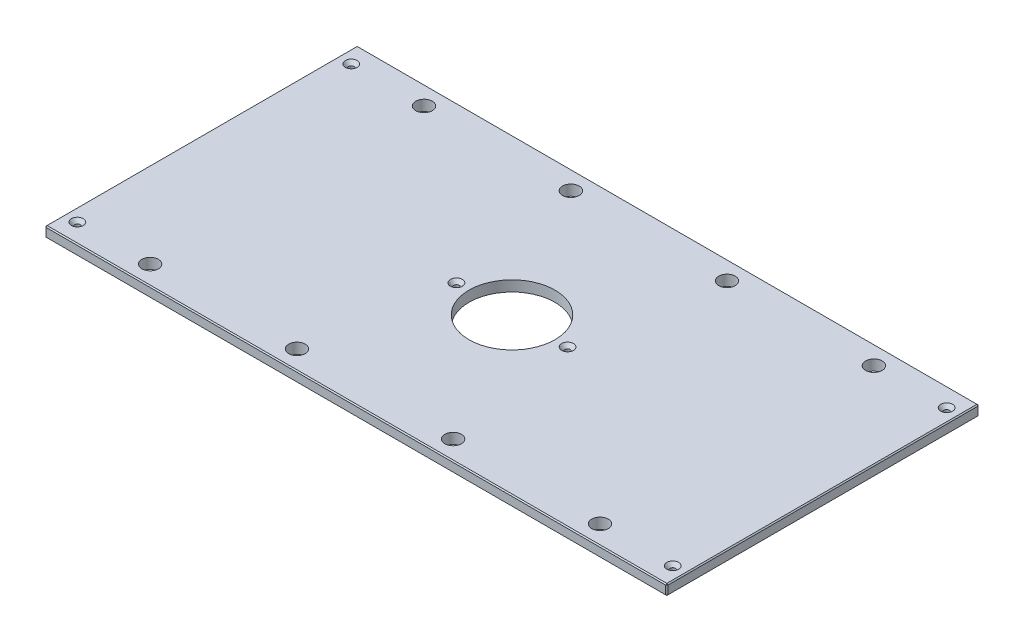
ISO-10303-21;
HEADER;
FILE_DESCRIPTION(('STEP AP214'),'2;1');
FILE_NAME('part.step','',(''),(''),'','','');
FILE_SCHEMA(('AUTOMOTIVE_DESIGN { 1 0 10303 214 1 1 1 1 }'));
ENDSEC;
DATA;
#1=APPLICATION_CONTEXT('core data for automotive mechanical design processes');
#2=APPLICATION_PROTOCOL_DEFINITION('international standard','automotive_design',2000,#1);
#3=PRODUCT_CONTEXT('',#1,'mechanical');
#4=PRODUCT('Part','Part','',(#3));
#5=PRODUCT_RELATED_PRODUCT_CATEGORY('part','',(#4));
#6=PRODUCT_DEFINITION_FORMATION('','',#4);
#7=PRODUCT_DEFINITION_CONTEXT('part definition',#1,'design');
#8=PRODUCT_DEFINITION('design','',#6,#7);
#9=PRODUCT_DEFINITION_SHAPE('','',#8);
#10=(LENGTH_UNIT() NAMED_UNIT(*) SI_UNIT(.MILLI.,.METRE.));
#11=(NAMED_UNIT(*) PLANE_ANGLE_UNIT() SI_UNIT($,.RADIAN.));
#12=(NAMED_UNIT(*) SI_UNIT($,.STERADIAN.) SOLID_ANGLE_UNIT());
#13=UNCERTAINTY_MEASURE_WITH_UNIT(LENGTH_MEASURE(1.E-05),#10,'distance_accuracy_value','');
#14=(GEOMETRIC_REPRESENTATION_CONTEXT(3) GLOBAL_UNCERTAINTY_ASSIGNED_CONTEXT((#13)) GLOBAL_UNIT_ASSIGNED_CONTEXT((#10,
#11,#12)) REPRESENTATION_CONTEXT('',''));
#15=CARTESIAN_POINT('',(0.,0.,0.));
#16=DIRECTION('',(0.,0.,1.));
#17=DIRECTION('',(1.,0.,0.));
#18=AXIS2_PLACEMENT_3D('',#15,#16,#17);
#19=CARTESIAN_POINT('',(-373.0625,12.7,-187.325));
#20=DIRECTION('',(1.,0.,0.));
#21=DIRECTION('',(0.,0.,-1.));
#22=AXIS2_PLACEMENT_3D('',#19,#20,#21);
#23=PLANE('',#22);
#24=DIRECTION('',(0.,0.,-1.));
#25=VECTOR('',#24,1.);
#26=CARTESIAN_POINT('',(-373.0625,11.4299999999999,-187.325));
#27=LINE('',#26,#25);
#28=CARTESIAN_POINT('',(-373.0625,11.4299999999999,186.055));
#29=VERTEX_POINT('',#28);
#30=CARTESIAN_POINT('',(-373.0625,11.4299999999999,-186.055));
#31=VERTEX_POINT('',#30);
#32=EDGE_CURVE('E135',#29,#31,#27,.T.);
#33=ORIENTED_EDGE('',*,*,#32,.T.);
#34=DIRECTION('',(0.,-1.,0.));
#35=VECTOR('',#34,1.);
#36=CARTESIAN_POINT('',(-373.0625,12.7,-186.055));
#37=LINE('',#36,#35);
#38=CARTESIAN_POINT('',(-373.0625,1.2700000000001,-186.055));
#39=VERTEX_POINT('',#38);
#40=EDGE_CURVE('E131',#31,#39,#37,.T.);
#41=ORIENTED_EDGE('',*,*,#40,.T.);
#42=DIRECTION('',(0.,0.,1.));
#43=VECTOR('',#42,1.);
#44=CARTESIAN_POINT('',(-373.0625,1.2700000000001,-187.325));
#45=LINE('',#44,#43);
#46=CARTESIAN_POINT('',(-373.0625,1.2700000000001,186.055));
#47=VERTEX_POINT('',#46);
#48=EDGE_CURVE('E126',#39,#47,#45,.T.);
#49=ORIENTED_EDGE('',*,*,#48,.T.);
#50=DIRECTION('',(0.,1.,0.));
#51=VECTOR('',#50,1.);
#52=CARTESIAN_POINT('',(-373.0625,12.7,186.055));
#53=LINE('',#52,#51);
#54=EDGE_CURVE('E128',#47,#29,#53,.T.);
#55=ORIENTED_EDGE('',*,*,#54,.T.);
#56=EDGE_LOOP('',(#33,#41,#49,#55));
#57=FACE_BOUND('',#56,.T.);
#58=ADVANCED_FACE('F35',(#57),#23,.F.);
#59=CARTESIAN_POINT('',(-373.0625,12.7,187.325));
#60=DIRECTION('',(0.,0.,-1.));
#61=DIRECTION('',(-1.,0.,0.));
#62=AXIS2_PLACEMENT_3D('',#59,#60,#61);
#63=PLANE('',#62);
#64=DIRECTION('',(1.,0.,0.));
#65=VECTOR('',#64,1.);
#66=CARTESIAN_POINT('',(-373.0625,1.26999999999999,187.325));
#67=LINE('',#66,#65);
#68=CARTESIAN_POINT('',(-371.7925,1.26999999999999,187.325));
#69=VERTEX_POINT('',#68);
#70=CARTESIAN_POINT('',(371.7925,1.26999999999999,187.325));
#71=VERTEX_POINT('',#70);
#72=EDGE_CURVE('E58',#69,#71,#67,.T.);
#73=ORIENTED_EDGE('',*,*,#72,.T.);
#74=DIRECTION('',(0.,1.,0.));
#75=VECTOR('',#74,1.);
#76=CARTESIAN_POINT('',(371.7925,12.7,187.325));
#77=LINE('',#76,#75);
#78=CARTESIAN_POINT('',(371.7925,11.43,187.325));
#79=VERTEX_POINT('',#78);
#80=EDGE_CURVE('E11',#71,#79,#77,.T.);
#81=ORIENTED_EDGE('',*,*,#80,.T.);
#82=DIRECTION('',(-1.,0.,0.));
#83=VECTOR('',#82,1.);
#84=CARTESIAN_POINT('',(-373.0625,11.43,187.325));
#85=LINE('',#84,#83);
#86=CARTESIAN_POINT('',(-371.7925,11.43,187.325));
#87=VERTEX_POINT('',#86);
#88=EDGE_CURVE('E44',#79,#87,#85,.T.);
#89=ORIENTED_EDGE('',*,*,#88,.T.);
#90=DIRECTION('',(0.,-1.,0.));
#91=VECTOR('',#90,1.);
#92=CARTESIAN_POINT('',(-371.7925,12.7,187.325));
#93=LINE('',#92,#91);
#94=EDGE_CURVE('E303',#87,#69,#93,.T.);
#95=ORIENTED_EDGE('',*,*,#94,.T.);
#96=EDGE_LOOP('',(#73,#81,#89,#95));
#97=FACE_BOUND('',#96,.T.);
#98=ADVANCED_FACE('F372',(#97),#63,.F.);
#99=CARTESIAN_POINT('',(373.0625,12.7,-187.325));
#100=DIRECTION('',(-1.,0.,0.));
#101=DIRECTION('',(0.,0.,1.));
#102=AXIS2_PLACEMENT_3D('',#99,#100,#101);
#103=PLANE('',#102);
#104=DIRECTION('',(0.,0.,-1.));
#105=VECTOR('',#104,1.);
#106=CARTESIAN_POINT('',(373.0625,1.26999999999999,-187.325));
#107=LINE('',#106,#105);
#108=CARTESIAN_POINT('',(373.0625,1.26999999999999,186.055));
#109=VERTEX_POINT('',#108);
#110=CARTESIAN_POINT('',(373.0625,1.26999999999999,-186.055));
#111=VERTEX_POINT('',#110);
#112=EDGE_CURVE('E298',#109,#111,#107,.T.);
#113=ORIENTED_EDGE('',*,*,#112,.T.);
#114=DIRECTION('',(0.,1.,0.));
#115=VECTOR('',#114,1.);
#116=CARTESIAN_POINT('',(373.0625,12.7,-186.055));
#117=LINE('',#116,#115);
#118=CARTESIAN_POINT('',(373.0625,11.4299999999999,-186.055));
#119=VERTEX_POINT('',#118);
#120=EDGE_CURVE('E300',#111,#119,#117,.T.);
#121=ORIENTED_EDGE('',*,*,#120,.T.);
#122=DIRECTION('',(0.,0.,1.));
#123=VECTOR('',#122,1.);
#124=CARTESIAN_POINT('',(373.0625,11.4299999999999,187.325));
#125=LINE('',#124,#123);
#126=CARTESIAN_POINT('',(373.0625,11.4299999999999,186.055));
#127=VERTEX_POINT('',#126);
#128=EDGE_CURVE('E296',#119,#127,#125,.T.);
#129=ORIENTED_EDGE('',*,*,#128,.T.);
#130=DIRECTION('',(0.,-1.,0.));
#131=VECTOR('',#130,1.);
#132=CARTESIAN_POINT('',(373.0625,12.7,186.055));
#133=LINE('',#132,#131);
#134=EDGE_CURVE('E294',#127,#109,#133,.T.);
#135=ORIENTED_EDGE('',*,*,#134,.T.);
#136=EDGE_LOOP('',(#113,#121,#129,#135));
#137=FACE_BOUND('',#136,.T.);
#138=ADVANCED_FACE('F359',(#137),#103,.F.);
#139=CARTESIAN_POINT('',(-373.0625,12.7,-187.325));
#140=DIRECTION('',(0.,0.,1.));
#141=DIRECTION('',(1.,0.,0.));
#142=AXIS2_PLACEMENT_3D('',#139,#140,#141);
#143=PLANE('',#142);
#144=DIRECTION('',(-1.,0.,0.));
#145=VECTOR('',#144,1.);
#146=CARTESIAN_POINT('',(-373.0625,1.26999999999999,-187.325));
#147=LINE('',#146,#145);
#148=CARTESIAN_POINT('',(371.7925,1.26999999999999,-187.325));
#149=VERTEX_POINT('',#148);
#150=CARTESIAN_POINT('',(-371.7925,1.26999999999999,-187.325));
#151=VERTEX_POINT('',#150);
#152=EDGE_CURVE('E270',#149,#151,#147,.T.);
#153=ORIENTED_EDGE('',*,*,#152,.T.);
#154=DIRECTION('',(0.,1.,0.));
#155=VECTOR('',#154,1.);
#156=CARTESIAN_POINT('',(-371.7925,12.7,-187.325));
#157=LINE('',#156,#155);
#158=CARTESIAN_POINT('',(-371.7925,11.4299999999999,-187.325));
#159=VERTEX_POINT('',#158);
#160=EDGE_CURVE('E274',#151,#159,#157,.T.);
#161=ORIENTED_EDGE('',*,*,#160,.T.);
#162=DIRECTION('',(1.,0.,0.));
#163=VECTOR('',#162,1.);
#164=CARTESIAN_POINT('',(373.0625,11.4299999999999,-187.325));
#165=LINE('',#164,#163);
#166=CARTESIAN_POINT('',(371.7925,11.4299999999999,-187.325));
#167=VERTEX_POINT('',#166);
#168=EDGE_CURVE('E272',#159,#167,#165,.T.);
#169=ORIENTED_EDGE('',*,*,#168,.T.);
#170=DIRECTION('',(0.,-1.,0.));
#171=VECTOR('',#170,1.);
#172=CARTESIAN_POINT('',(371.7925,12.7,-187.325));
#173=LINE('',#172,#171);
#174=EDGE_CURVE('E268',#167,#149,#173,.T.);
#175=ORIENTED_EDGE('',*,*,#174,.T.);
#176=EDGE_LOOP('',(#153,#161,#169,#175));
#177=FACE_BOUND('',#176,.T.);
#178=ADVANCED_FACE('F333',(#177),#143,.F.);
#179=CARTESIAN_POINT('',(0.,12.7,0.));
#180=DIRECTION('',(0.,1.,0.));
#181=DIRECTION('',(0.,0.,1.));
#182=AXIS2_PLACEMENT_3D('',#179,#180,#181);
#183=PLANE('',#182);
#184=CARTESIAN_POINT('',(357.1875,12.7,-164.30498));
#185=DIRECTION('',(0.,1.,0.));
#186=DIRECTION('',(0.,0.,1.));
#187=AXIS2_PLACEMENT_3D('',#184,#185,#186);
#188=CIRCLE('',#187,7.13740000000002);
#189=CARTESIAN_POINT('',(357.1875,12.7,-157.16758));
#190=VERTEX_POINT('',#189);
#191=EDGE_CURVE('E816',#190,#190,#188,.T.);
#192=ORIENTED_EDGE('',*,*,#191,.F.);
#193=EDGE_LOOP('',(#192));
#194=FACE_BOUND('',#193,.T.);
#195=CARTESIAN_POINT('',(357.1875,12.7,164.30498));
#196=DIRECTION('',(0.,1.,0.));
#197=DIRECTION('',(0.,0.,1.));
#198=AXIS2_PLACEMENT_3D('',#195,#196,#197);
#199=CIRCLE('',#198,7.13740000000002);
#200=CARTESIAN_POINT('',(357.1875,12.7,171.44238));
#201=VERTEX_POINT('',#200);
#202=EDGE_CURVE('E820',#201,#201,#199,.T.);
#203=ORIENTED_EDGE('',*,*,#202,.F.);
#204=EDGE_LOOP('',(#203));
#205=FACE_BOUND('',#204,.T.);
#206=CARTESIAN_POINT('',(-357.1875,12.7,164.30498));
#207=DIRECTION('',(0.,1.,0.));
#208=DIRECTION('',(0.,0.,1.));
#209=AXIS2_PLACEMENT_3D('',#206,#207,#208);
#210=CIRCLE('',#209,7.13740000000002);
#211=CARTESIAN_POINT('',(-357.1875,12.7,171.44238));
#212=VERTEX_POINT('',#211);
#213=EDGE_CURVE('E824',#212,#212,#210,.T.);
#214=ORIENTED_EDGE('',*,*,#213,.F.);
#215=EDGE_LOOP('',(#214));
#216=FACE_BOUND('',#215,.T.);
#217=CARTESIAN_POINT('',(-66.675,12.7,0.));
#218=DIRECTION('',(0.,1.,0.));
#219=DIRECTION('',(0.,0.,1.));
#220=AXIS2_PLACEMENT_3D('',#217,#218,#219);
#221=CIRCLE('',#220,7.1374);
#222=CARTESIAN_POINT('',(-66.675,12.7,7.1374));
#223=VERTEX_POINT('',#222);
#224=EDGE_CURVE('E828',#223,#223,#221,.T.);
#225=ORIENTED_EDGE('',*,*,#224,.F.);
#226=EDGE_LOOP('',(#225));
#227=FACE_BOUND('',#226,.T.);
#228=CARTESIAN_POINT('',(66.675,12.7,0.));
#229=DIRECTION('',(0.,1.,0.));
#230=DIRECTION('',(0.,0.,1.));
#231=AXIS2_PLACEMENT_3D('',#228,#229,#230);
#232=CIRCLE('',#231,7.1374);
#233=CARTESIAN_POINT('',(66.675,12.7,7.1374));
#234=VERTEX_POINT('',#233);
#235=EDGE_CURVE('E832',#234,#234,#232,.T.);
#236=ORIENTED_EDGE('',*,*,#235,.F.);
#237=EDGE_LOOP('',(#236));
#238=FACE_BOUND('',#237,.T.);
#239=CARTESIAN_POINT('',(-357.1875,12.7,-164.30498));
#240=DIRECTION('',(0.,1.,0.));
#241=DIRECTION('',(0.,0.,1.));
#242=AXIS2_PLACEMENT_3D('',#239,#240,#241);
#243=CIRCLE('',#242,7.13740000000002);
#244=CARTESIAN_POINT('',(-357.1875,12.7,-157.16758));
#245=VERTEX_POINT('',#244);
#246=EDGE_CURVE('E835',#245,#245,#243,.T.);
#247=ORIENTED_EDGE('',*,*,#246,.F.);
#248=EDGE_LOOP('',(#247));
#249=FACE_BOUND('',#248,.T.);
#250=DIRECTION('',(0.,0.,-1.));
#251=VECTOR('',#250,1.);
#252=CARTESIAN_POINT('',(371.7925,12.7,-187.325));
#253=LINE('',#252,#251);
#254=CARTESIAN_POINT('',(371.7925,12.7,186.055));
#255=VERTEX_POINT('',#254);
#256=CARTESIAN_POINT('',(371.7925,12.7,-186.055));
#257=VERTEX_POINT('',#256);
#258=EDGE_CURVE('E281',#255,#257,#253,.T.);
#259=ORIENTED_EDGE('',*,*,#258,.T.);
#260=DIRECTION('',(-1.,0.,0.));
#261=VECTOR('',#260,1.);
#262=CARTESIAN_POINT('',(-373.0625,12.7,-186.055));
#263=LINE('',#262,#261);
#264=CARTESIAN_POINT('',(-371.7925,12.7,-186.055));
#265=VERTEX_POINT('',#264);
#266=EDGE_CURVE('E283',#257,#265,#263,.T.);
#267=ORIENTED_EDGE('',*,*,#266,.T.);
#268=DIRECTION('',(0.,0.,1.));
#269=VECTOR('',#268,1.);
#270=CARTESIAN_POINT('',(-371.7925,12.7,187.325));
#271=LINE('',#270,#269);
#272=CARTESIAN_POINT('',(-371.7925,12.7,186.055));
#273=VERTEX_POINT('',#272);
#274=EDGE_CURVE('E279',#265,#273,#271,.T.);
#275=ORIENTED_EDGE('',*,*,#274,.T.);
#276=DIRECTION('',(1.,0.,0.));
#277=VECTOR('',#276,1.);
#278=CARTESIAN_POINT('',(373.0625,12.7,186.055));
#279=LINE('',#278,#277);
#280=EDGE_CURVE('E277',#273,#255,#279,.T.);
#281=ORIENTED_EDGE('',*,*,#280,.T.);
#282=EDGE_LOOP('',(#259,#267,#275,#281));
#283=FACE_BOUND('',#282,.T.);
#284=CARTESIAN_POINT('',(269.875,12.7,-164.30498));
#285=DIRECTION('',(0.,1.,0.));
#286=DIRECTION('',(0.,0.,1.));
#287=AXIS2_PLACEMENT_3D('',#284,#285,#286);
#288=CIRCLE('',#287,9.92187500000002);
#289=CARTESIAN_POINT('',(269.875,12.7,-154.383105));
#290=VERTEX_POINT('',#289);
#291=EDGE_CURVE('E204',#290,#290,#288,.T.);
#292=ORIENTED_EDGE('',*,*,#291,.F.);
#293=EDGE_LOOP('',(#292));
#294=FACE_BOUND('',#293,.T.);
#295=CARTESIAN_POINT('',(-269.875,12.7,-164.30498));
#296=DIRECTION('',(0.,1.,0.));
#297=DIRECTION('',(0.,0.,1.));
#298=AXIS2_PLACEMENT_3D('',#295,#296,#297);
#299=CIRCLE('',#298,9.92187500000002);
#300=CARTESIAN_POINT('',(-269.875,12.7,-154.383105));
#301=VERTEX_POINT('',#300);
#302=EDGE_CURVE('E214',#301,#301,#299,.T.);
#303=ORIENTED_EDGE('',*,*,#302,.F.);
#304=EDGE_LOOP('',(#303));
#305=FACE_BOUND('',#304,.T.);
#306=CARTESIAN_POINT('',(269.875,12.7,164.30498));
#307=DIRECTION('',(0.,1.,0.));
#308=DIRECTION('',(0.,0.,1.));
#309=AXIS2_PLACEMENT_3D('',#306,#307,#308);
#310=CIRCLE('',#309,9.92187500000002);
#311=CARTESIAN_POINT('',(269.875,12.7,174.226855));
#312=VERTEX_POINT('',#311);
#313=EDGE_CURVE('E225',#312,#312,#310,.T.);
#314=ORIENTED_EDGE('',*,*,#313,.F.);
#315=EDGE_LOOP('',(#314));
#316=FACE_BOUND('',#315,.T.);
#317=CARTESIAN_POINT('',(-269.875,12.7,164.30498));
#318=DIRECTION('',(0.,1.,0.));
#319=DIRECTION('',(0.,0.,1.));
#320=AXIS2_PLACEMENT_3D('',#317,#318,#319);
#321=CIRCLE('',#320,9.92187500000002);
#322=CARTESIAN_POINT('',(-269.875,12.7,174.226855));
#323=VERTEX_POINT('',#322);
#324=EDGE_CURVE('E231',#323,#323,#321,.T.);
#325=ORIENTED_EDGE('',*,*,#324,.F.);
#326=EDGE_LOOP('',(#325));
#327=FACE_BOUND('',#326,.T.);
#328=CARTESIAN_POINT('',(-93.6625,12.7,-164.30498));
#329=DIRECTION('',(0.,1.,0.));
#330=DIRECTION('',(0.,0.,1.));
#331=AXIS2_PLACEMENT_3D('',#328,#329,#330);
#332=CIRCLE('',#331,9.921875);
#333=CARTESIAN_POINT('',(-93.6625,12.7,-154.383105));
#334=VERTEX_POINT('',#333);
#335=EDGE_CURVE('E237',#334,#334,#332,.T.);
#336=ORIENTED_EDGE('',*,*,#335,.F.);
#337=EDGE_LOOP('',(#336));
#338=FACE_BOUND('',#337,.T.);
#339=CARTESIAN_POINT('',(93.6625,12.7,-164.30498));
#340=DIRECTION('',(0.,1.,0.));
#341=DIRECTION('',(0.,0.,1.));
#342=AXIS2_PLACEMENT_3D('',#339,#340,#341);
#343=CIRCLE('',#342,9.921875);
#344=CARTESIAN_POINT('',(93.6625,12.7,-154.383105));
#345=VERTEX_POINT('',#344);
#346=EDGE_CURVE('E243',#345,#345,#343,.T.);
#347=ORIENTED_EDGE('',*,*,#346,.F.);
#348=EDGE_LOOP('',(#347));
#349=FACE_BOUND('',#348,.T.);
#350=CARTESIAN_POINT('',(93.6625,12.7,164.30498));
#351=DIRECTION('',(0.,1.,0.));
#352=DIRECTION('',(0.,0.,1.));
#353=AXIS2_PLACEMENT_3D('',#350,#351,#352);
#354=CIRCLE('',#353,9.921875);
#355=CARTESIAN_POINT('',(93.6625,12.7,174.226855));
#356=VERTEX_POINT('',#355);
#357=EDGE_CURVE('E249',#356,#356,#354,.T.);
#358=ORIENTED_EDGE('',*,*,#357,.F.);
#359=EDGE_LOOP('',(#358));
#360=FACE_BOUND('',#359,.T.);
#361=CARTESIAN_POINT('',(-93.6625,12.7,164.30498));
#362=DIRECTION('',(0.,1.,0.));
#363=DIRECTION('',(0.,0.,1.));
#364=AXIS2_PLACEMENT_3D('',#361,#362,#363);
#365=CIRCLE('',#364,9.921875);
#366=CARTESIAN_POINT('',(-93.6625,12.7,174.226855));
#367=VERTEX_POINT('',#366);
#368=EDGE_CURVE('E255',#367,#367,#365,.T.);
#369=ORIENTED_EDGE('',*,*,#368,.F.);
#370=EDGE_LOOP('',(#369));
#371=FACE_BOUND('',#370,.T.);
#372=CARTESIAN_POINT('',(0.,12.7,0.));
#373=DIRECTION('',(0.,1.,0.));
#374=DIRECTION('',(0.,0.,1.));
#375=AXIS2_PLACEMENT_3D('',#372,#373,#374);
#376=CIRCLE('',#375,51.562);
#377=CARTESIAN_POINT('',(0.,12.7,51.562));
#378=VERTEX_POINT('',#377);
#379=EDGE_CURVE('E261',#378,#378,#376,.T.);
#380=ORIENTED_EDGE('',*,*,#379,.F.);
#381=EDGE_LOOP('',(#380));
#382=FACE_BOUND('',#381,.T.);
#383=ADVANCED_FACE('F381',(#194,#205,#216,#227,#238,#249,#283,#294,#305,#316,#327,#338,#349,
#360,#371,#382),#183,.T.);
#384=CARTESIAN_POINT('',(0.,0.,0.));
#385=DIRECTION('',(0.,1.,0.));
#386=DIRECTION('',(0.,0.,1.));
#387=AXIS2_PLACEMENT_3D('',#384,#385,#386);
#388=PLANE('',#387);
#389=CARTESIAN_POINT('',(357.1875,0.,-164.30498));
#390=DIRECTION('',(0.,1.,0.));
#391=DIRECTION('',(0.,0.,1.));
#392=AXIS2_PLACEMENT_3D('',#389,#390,#391);
#393=CIRCLE('',#392,3.3782);
#394=CARTESIAN_POINT('',(357.1875,0.,-160.92678));
#395=VERTEX_POINT('',#394);
#396=EDGE_CURVE('E869',#395,#395,#393,.T.);
#397=ORIENTED_EDGE('',*,*,#396,.T.);
#398=EDGE_LOOP('',(#397));
#399=FACE_BOUND('',#398,.T.);
#400=CARTESIAN_POINT('',(357.1875,0.,164.30498));
#401=DIRECTION('',(0.,1.,0.));
#402=DIRECTION('',(0.,0.,1.));
#403=AXIS2_PLACEMENT_3D('',#400,#401,#402);
#404=CIRCLE('',#403,3.3782);
#405=CARTESIAN_POINT('',(357.1875,0.,167.68318));
#406=VERTEX_POINT('',#405);
#407=EDGE_CURVE('E862',#406,#406,#404,.T.);
#408=ORIENTED_EDGE('',*,*,#407,.T.);
#409=EDGE_LOOP('',(#408));
#410=FACE_BOUND('',#409,.T.);
#411=CARTESIAN_POINT('',(-357.1875,0.,164.30498));
#412=DIRECTION('',(0.,1.,0.));
#413=DIRECTION('',(0.,0.,1.));
#414=AXIS2_PLACEMENT_3D('',#411,#412,#413);
#415=CIRCLE('',#414,3.3782);
#416=CARTESIAN_POINT('',(-357.1875,0.,167.68318));
#417=VERTEX_POINT('',#416);
#418=EDGE_CURVE('E855',#417,#417,#415,.T.);
#419=ORIENTED_EDGE('',*,*,#418,.T.);
#420=EDGE_LOOP('',(#419));
#421=FACE_BOUND('',#420,.T.);
#422=CARTESIAN_POINT('',(-66.675,0.,0.));
#423=DIRECTION('',(0.,1.,0.));
#424=DIRECTION('',(0.,0.,1.));
#425=AXIS2_PLACEMENT_3D('',#422,#423,#424);
#426=CIRCLE('',#425,3.3782);
#427=CARTESIAN_POINT('',(-66.675,0.,3.3782));
#428=VERTEX_POINT('',#427);
#429=EDGE_CURVE('E848',#428,#428,#426,.T.);
#430=ORIENTED_EDGE('',*,*,#429,.T.);
#431=EDGE_LOOP('',(#430));
#432=FACE_BOUND('',#431,.T.);
#433=CARTESIAN_POINT('',(66.675,0.,0.));
#434=DIRECTION('',(0.,1.,0.));
#435=DIRECTION('',(0.,0.,1.));
#436=AXIS2_PLACEMENT_3D('',#433,#434,#435);
#437=CIRCLE('',#436,3.3782);
#438=CARTESIAN_POINT('',(66.675,0.,3.3782));
#439=VERTEX_POINT('',#438);
#440=EDGE_CURVE('E838',#439,#439,#437,.T.);
#441=ORIENTED_EDGE('',*,*,#440,.T.);
#442=EDGE_LOOP('',(#441));
#443=FACE_BOUND('',#442,.T.);
#444=CARTESIAN_POINT('',(-357.1875,0.,-164.30498));
#445=DIRECTION('',(0.,1.,0.));
#446=DIRECTION('',(0.,0.,1.));
#447=AXIS2_PLACEMENT_3D('',#444,#445,#446);
#448=CIRCLE('',#447,3.3782);
#449=CARTESIAN_POINT('',(-357.1875,0.,-160.92678));
#450=VERTEX_POINT('',#449);
#451=EDGE_CURVE('E217',#450,#450,#448,.T.);
#452=ORIENTED_EDGE('',*,*,#451,.T.);
#453=EDGE_LOOP('',(#452));
#454=FACE_BOUND('',#453,.T.);
#455=DIRECTION('',(0.,0.,-1.));
#456=VECTOR('',#455,1.);
#457=CARTESIAN_POINT('',(-371.7925,0.,0.));
#458=LINE('',#457,#456);
#459=CARTESIAN_POINT('',(-371.7925,0.,186.055));
#460=VERTEX_POINT('',#459);
#461=CARTESIAN_POINT('',(-371.7925,0.,-186.055));
#462=VERTEX_POINT('',#461);
#463=EDGE_CURVE('E158',#460,#462,#458,.T.);
#464=ORIENTED_EDGE('',*,*,#463,.T.);
#465=DIRECTION('',(1.,0.,0.));
#466=VECTOR('',#465,1.);
#467=CARTESIAN_POINT('',(0.,0.,-186.055));
#468=LINE('',#467,#466);
#469=CARTESIAN_POINT('',(371.7925,0.,-186.055));
#470=VERTEX_POINT('',#469);
#471=EDGE_CURVE('E291',#462,#470,#468,.T.);
#472=ORIENTED_EDGE('',*,*,#471,.T.);
#473=DIRECTION('',(0.,0.,1.));
#474=VECTOR('',#473,1.);
#475=CARTESIAN_POINT('',(371.7925,0.,0.));
#476=LINE('',#475,#474);
#477=CARTESIAN_POINT('',(371.7925,0.,186.055));
#478=VERTEX_POINT('',#477);
#479=EDGE_CURVE('E289',#470,#478,#476,.T.);
#480=ORIENTED_EDGE('',*,*,#479,.T.);
#481=DIRECTION('',(-1.,0.,0.));
#482=VECTOR('',#481,1.);
#483=CARTESIAN_POINT('',(0.,0.,186.055));
#484=LINE('',#483,#482);
#485=EDGE_CURVE('E286',#478,#460,#484,.T.);
#486=ORIENTED_EDGE('',*,*,#485,.T.);
#487=EDGE_LOOP('',(#464,#472,#480,#486));
#488=FACE_BOUND('',#487,.T.);
#489=CARTESIAN_POINT('',(269.875,0.,-164.30498));
#490=DIRECTION('',(0.,1.,0.));
#491=DIRECTION('',(0.,0.,1.));
#492=AXIS2_PLACEMENT_3D('',#489,#490,#491);
#493=CIRCLE('',#492,9.92187500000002);
#494=CARTESIAN_POINT('',(269.875,0.,-154.383105));
#495=VERTEX_POINT('',#494);
#496=EDGE_CURVE('E209',#495,#495,#493,.T.);
#497=ORIENTED_EDGE('',*,*,#496,.T.);
#498=EDGE_LOOP('',(#497));
#499=FACE_BOUND('',#498,.T.);
#500=CARTESIAN_POINT('',(-269.875,0.,-164.30498));
#501=DIRECTION('',(0.,1.,0.));
#502=DIRECTION('',(0.,0.,1.));
#503=AXIS2_PLACEMENT_3D('',#500,#501,#502);
#504=CIRCLE('',#503,9.92187500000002);
#505=CARTESIAN_POINT('',(-269.875,0.,-154.383105));
#506=VERTEX_POINT('',#505);
#507=EDGE_CURVE('E222',#506,#506,#504,.T.);
#508=ORIENTED_EDGE('',*,*,#507,.T.);
#509=EDGE_LOOP('',(#508));
#510=FACE_BOUND('',#509,.T.);
#511=CARTESIAN_POINT('',(269.875,0.,164.30498));
#512=DIRECTION('',(0.,1.,0.));
#513=DIRECTION('',(0.,0.,1.));
#514=AXIS2_PLACEMENT_3D('',#511,#512,#513);
#515=CIRCLE('',#514,9.92187500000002);
#516=CARTESIAN_POINT('',(269.875,0.,174.226855));
#517=VERTEX_POINT('',#516);
#518=EDGE_CURVE('E228',#517,#517,#515,.T.);
#519=ORIENTED_EDGE('',*,*,#518,.T.);
#520=EDGE_LOOP('',(#519));
#521=FACE_BOUND('',#520,.T.);
#522=CARTESIAN_POINT('',(-269.875,0.,164.30498));
#523=DIRECTION('',(0.,1.,0.));
#524=DIRECTION('',(0.,0.,1.));
#525=AXIS2_PLACEMENT_3D('',#522,#523,#524);
#526=CIRCLE('',#525,9.92187500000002);
#527=CARTESIAN_POINT('',(-269.875,0.,174.226855));
#528=VERTEX_POINT('',#527);
#529=EDGE_CURVE('E234',#528,#528,#526,.T.);
#530=ORIENTED_EDGE('',*,*,#529,.T.);
#531=EDGE_LOOP('',(#530));
#532=FACE_BOUND('',#531,.T.);
#533=CARTESIAN_POINT('',(-93.6625,0.,-164.30498));
#534=DIRECTION('',(0.,1.,0.));
#535=DIRECTION('',(0.,0.,1.));
#536=AXIS2_PLACEMENT_3D('',#533,#534,#535);
#537=CIRCLE('',#536,9.921875);
#538=CARTESIAN_POINT('',(-93.6625,0.,-154.383105));
#539=VERTEX_POINT('',#538);
#540=EDGE_CURVE('E240',#539,#539,#537,.T.);
#541=ORIENTED_EDGE('',*,*,#540,.T.);
#542=EDGE_LOOP('',(#541));
#543=FACE_BOUND('',#542,.T.);
#544=CARTESIAN_POINT('',(93.6625,0.,-164.30498));
#545=DIRECTION('',(0.,1.,0.));
#546=DIRECTION('',(0.,0.,1.));
#547=AXIS2_PLACEMENT_3D('',#544,#545,#546);
#548=CIRCLE('',#547,9.921875);
#549=CARTESIAN_POINT('',(93.6625,0.,-154.383105));
#550=VERTEX_POINT('',#549);
#551=EDGE_CURVE('E246',#550,#550,#548,.T.);
#552=ORIENTED_EDGE('',*,*,#551,.T.);
#553=EDGE_LOOP('',(#552));
#554=FACE_BOUND('',#553,.T.);
#555=CARTESIAN_POINT('',(93.6625,0.,164.30498));
#556=DIRECTION('',(0.,1.,0.));
#557=DIRECTION('',(0.,0.,1.));
#558=AXIS2_PLACEMENT_3D('',#555,#556,#557);
#559=CIRCLE('',#558,9.921875);
#560=CARTESIAN_POINT('',(93.6625,0.,174.226855));
#561=VERTEX_POINT('',#560);
#562=EDGE_CURVE('E252',#561,#561,#559,.T.);
#563=ORIENTED_EDGE('',*,*,#562,.T.);
#564=EDGE_LOOP('',(#563));
#565=FACE_BOUND('',#564,.T.);
#566=CARTESIAN_POINT('',(-93.6625,0.,164.30498));
#567=DIRECTION('',(0.,1.,0.));
#568=DIRECTION('',(0.,0.,1.));
#569=AXIS2_PLACEMENT_3D('',#566,#567,#568);
#570=CIRCLE('',#569,9.921875);
#571=CARTESIAN_POINT('',(-93.6625,0.,174.226855));
#572=VERTEX_POINT('',#571);
#573=EDGE_CURVE('E258',#572,#572,#570,.T.);
#574=ORIENTED_EDGE('',*,*,#573,.T.);
#575=EDGE_LOOP('',(#574));
#576=FACE_BOUND('',#575,.T.);
#577=CARTESIAN_POINT('',(0.,0.,0.));
#578=DIRECTION('',(0.,1.,0.));
#579=DIRECTION('',(0.,0.,1.));
#580=AXIS2_PLACEMENT_3D('',#577,#578,#579);
#581=CIRCLE('',#580,51.562);
#582=CARTESIAN_POINT('',(0.,0.,51.562));
#583=VERTEX_POINT('',#582);
#584=EDGE_CURVE('E147',#583,#583,#581,.T.);
#585=ORIENTED_EDGE('',*,*,#584,.T.);
#586=EDGE_LOOP('',(#585));
#587=FACE_BOUND('',#586,.T.);
#588=ADVANCED_FACE('F346',(#399,#410,#421,#432,#443,#454,#488,#499,#510,#521,#532,#543,#554,
#565,#576,#587),#388,.F.);
#589=CARTESIAN_POINT('',(0.,0.,0.));
#590=DIRECTION('',(0.,1.,0.));
#591=DIRECTION('',(0.,0.,1.));
#592=AXIS2_PLACEMENT_3D('',#589,#590,#591);
#593=CYLINDRICAL_SURFACE('',#592,51.562);
#594=ORIENTED_EDGE('',*,*,#584,.F.);
#595=EDGE_LOOP('',(#594));
#596=FACE_BOUND('',#595,.T.);
#597=ORIENTED_EDGE('',*,*,#379,.T.);
#598=EDGE_LOOP('',(#597));
#599=FACE_BOUND('',#598,.T.);
#600=ADVANCED_FACE('F751',(#596,#599),#593,.F.);
#601=CARTESIAN_POINT('',(-93.6625,12.7,164.30498));
#602=DIRECTION('',(0.,1.,0.));
#603=DIRECTION('',(0.,0.,1.));
#604=AXIS2_PLACEMENT_3D('',#601,#602,#603);
#605=CYLINDRICAL_SURFACE('',#604,9.921875);
#606=ORIENTED_EDGE('',*,*,#573,.F.);
#607=EDGE_LOOP('',(#606));
#608=FACE_BOUND('',#607,.T.);
#609=ORIENTED_EDGE('',*,*,#368,.T.);
#610=EDGE_LOOP('',(#609));
#611=FACE_BOUND('',#610,.T.);
#612=ADVANCED_FACE('F742',(#608,#611),#605,.F.);
#613=CARTESIAN_POINT('',(93.6625,12.7,164.30498));
#614=DIRECTION('',(0.,1.,0.));
#615=DIRECTION('',(0.,0.,1.));
#616=AXIS2_PLACEMENT_3D('',#613,#614,#615);
#617=CYLINDRICAL_SURFACE('',#616,9.921875);
#618=ORIENTED_EDGE('',*,*,#562,.F.);
#619=EDGE_LOOP('',(#618));
#620=FACE_BOUND('',#619,.T.);
#621=ORIENTED_EDGE('',*,*,#357,.T.);
#622=EDGE_LOOP('',(#621));
#623=FACE_BOUND('',#622,.T.);
#624=ADVANCED_FACE('F733',(#620,#623),#617,.F.);
#625=CARTESIAN_POINT('',(93.6625,12.7,-164.30498));
#626=DIRECTION('',(0.,1.,0.));
#627=DIRECTION('',(0.,0.,1.));
#628=AXIS2_PLACEMENT_3D('',#625,#626,#627);
#629=CYLINDRICAL_SURFACE('',#628,9.921875);
#630=ORIENTED_EDGE('',*,*,#551,.F.);
#631=EDGE_LOOP('',(#630));
#632=FACE_BOUND('',#631,.T.);
#633=ORIENTED_EDGE('',*,*,#346,.T.);
#634=EDGE_LOOP('',(#633));
#635=FACE_BOUND('',#634,.T.);
#636=ADVANCED_FACE('F724',(#632,#635),#629,.F.);
#637=CARTESIAN_POINT('',(-93.6625,12.7,-164.30498));
#638=DIRECTION('',(0.,1.,0.));
#639=DIRECTION('',(0.,0.,1.));
#640=AXIS2_PLACEMENT_3D('',#637,#638,#639);
#641=CYLINDRICAL_SURFACE('',#640,9.921875);
#642=ORIENTED_EDGE('',*,*,#540,.F.);
#643=EDGE_LOOP('',(#642));
#644=FACE_BOUND('',#643,.T.);
#645=ORIENTED_EDGE('',*,*,#335,.T.);
#646=EDGE_LOOP('',(#645));
#647=FACE_BOUND('',#646,.T.);
#648=ADVANCED_FACE('F715',(#644,#647),#641,.F.);
#649=CARTESIAN_POINT('',(-269.875,12.7,164.30498));
#650=DIRECTION('',(0.,1.,0.));
#651=DIRECTION('',(0.,0.,1.));
#652=AXIS2_PLACEMENT_3D('',#649,#650,#651);
#653=CYLINDRICAL_SURFACE('',#652,9.92187500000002);
#654=ORIENTED_EDGE('',*,*,#529,.F.);
#655=EDGE_LOOP('',(#654));
#656=FACE_BOUND('',#655,.T.);
#657=ORIENTED_EDGE('',*,*,#324,.T.);
#658=EDGE_LOOP('',(#657));
#659=FACE_BOUND('',#658,.T.);
#660=ADVANCED_FACE('F706',(#656,#659),#653,.F.);
#661=CARTESIAN_POINT('',(269.875,12.7,164.30498));
#662=DIRECTION('',(0.,1.,0.));
#663=DIRECTION('',(0.,0.,1.));
#664=AXIS2_PLACEMENT_3D('',#661,#662,#663);
#665=CYLINDRICAL_SURFACE('',#664,9.92187500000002);
#666=ORIENTED_EDGE('',*,*,#518,.F.);
#667=EDGE_LOOP('',(#666));
#668=FACE_BOUND('',#667,.T.);
#669=ORIENTED_EDGE('',*,*,#313,.T.);
#670=EDGE_LOOP('',(#669));
#671=FACE_BOUND('',#670,.T.);
#672=ADVANCED_FACE('F697',(#668,#671),#665,.F.);
#673=CARTESIAN_POINT('',(-269.875,12.7,-164.30498));
#674=DIRECTION('',(0.,1.,0.));
#675=DIRECTION('',(0.,0.,1.));
#676=AXIS2_PLACEMENT_3D('',#673,#674,#675);
#677=CYLINDRICAL_SURFACE('',#676,9.92187500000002);
#678=ORIENTED_EDGE('',*,*,#507,.F.);
#679=EDGE_LOOP('',(#678));
#680=FACE_BOUND('',#679,.T.);
#681=ORIENTED_EDGE('',*,*,#302,.T.);
#682=EDGE_LOOP('',(#681));
#683=FACE_BOUND('',#682,.T.);
#684=ADVANCED_FACE('F687',(#680,#683),#677,.F.);
#685=CARTESIAN_POINT('',(269.875,12.7,-164.30498));
#686=DIRECTION('',(0.,1.,0.));
#687=DIRECTION('',(0.,0.,1.));
#688=AXIS2_PLACEMENT_3D('',#685,#686,#687);
#689=CYLINDRICAL_SURFACE('',#688,9.92187500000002);
#690=ORIENTED_EDGE('',*,*,#496,.F.);
#691=EDGE_LOOP('',(#690));
#692=FACE_BOUND('',#691,.T.);
#693=ORIENTED_EDGE('',*,*,#291,.T.);
#694=EDGE_LOOP('',(#693));
#695=FACE_BOUND('',#694,.T.);
#696=ADVANCED_FACE('F390',(#692,#695),#689,.F.);
#697=CARTESIAN_POINT('',(373.0625,12.7,186.055));
#698=DIRECTION('',(-0.707106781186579,0.,-0.707106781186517));
#699=DIRECTION('',(0.,-1.,0.));
#700=AXIS2_PLACEMENT_3D('',#697,#698,#699);
#701=PLANE('',#700);
#702=DIRECTION('',(-0.707106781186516,0.,0.707106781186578));
#703=VECTOR('',#702,1.);
#704=CARTESIAN_POINT('',(373.0625,11.4299999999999,186.055));
#705=LINE('',#704,#703);
#706=EDGE_CURVE('E39',#79,#127,#705,.F.);
#707=ORIENTED_EDGE('',*,*,#706,.F.);
#708=ORIENTED_EDGE('',*,*,#80,.F.);
#709=DIRECTION('',(0.707106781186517,0.,-0.707106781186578));
#710=VECTOR('',#709,1.);
#711=CARTESIAN_POINT('',(372.4275,1.26999999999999,186.69));
#712=LINE('',#711,#710);
#713=EDGE_CURVE('E197',#109,#71,#712,.F.);
#714=ORIENTED_EDGE('',*,*,#713,.F.);
#715=ORIENTED_EDGE('',*,*,#134,.F.);
#716=EDGE_LOOP('',(#707,#708,#714,#715));
#717=FACE_BOUND('',#716,.T.);
#718=ADVANCED_FACE('F37',(#717),#701,.F.);
#719=CARTESIAN_POINT('',(373.0625,11.4299999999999,186.055));
#720=DIRECTION('',(0.577350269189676,0.577350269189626,0.577350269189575));
#721=DIRECTION('',(-0.707106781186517,0.707106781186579,0.));
#722=AXIS2_PLACEMENT_3D('',#719,#720,#721);
#723=PLANE('',#722);
#724=DIRECTION('',(0.,-0.707106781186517,0.707106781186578));
#725=VECTOR('',#724,1.);
#726=CARTESIAN_POINT('',(371.7925,12.065,186.69));
#727=LINE('',#726,#725);
#728=EDGE_CURVE('E193',#79,#255,#727,.F.);
#729=ORIENTED_EDGE('',*,*,#728,.F.);
#730=ORIENTED_EDGE('',*,*,#706,.T.);
#731=DIRECTION('',(-0.707106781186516,0.707106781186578,0.));
#732=VECTOR('',#731,1.);
#733=CARTESIAN_POINT('',(373.0625,11.4299999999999,186.055));
#734=LINE('',#733,#732);
#735=EDGE_CURVE('E195',#255,#127,#734,.F.);
#736=ORIENTED_EDGE('',*,*,#735,.F.);
#737=EDGE_LOOP('',(#729,#730,#736));
#738=FACE_BOUND('',#737,.T.);
#739=ADVANCED_FACE('F383',(#738),#723,.T.);
#740=CARTESIAN_POINT('',(371.7925,0.,186.055));
#741=DIRECTION('',(0.577350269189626,-0.577350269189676,0.577350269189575));
#742=DIRECTION('',(0.707106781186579,0.707106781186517,0.));
#743=AXIS2_PLACEMENT_3D('',#740,#741,#742);
#744=PLANE('',#743);
#745=DIRECTION('',(-0.707106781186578,-0.707106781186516,0.));
#746=VECTOR('',#745,1.);
#747=CARTESIAN_POINT('',(371.7925,0.,186.055));
#748=LINE('',#747,#746);
#749=EDGE_CURVE('E187',#109,#478,#748,.T.);
#750=ORIENTED_EDGE('',*,*,#749,.F.);
#751=ORIENTED_EDGE('',*,*,#713,.T.);
#752=DIRECTION('',(0.,0.707106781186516,0.707106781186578));
#753=VECTOR('',#752,1.);
#754=CARTESIAN_POINT('',(371.7925,0.,186.055));
#755=LINE('',#754,#753);
#756=EDGE_CURVE('E190',#478,#71,#755,.T.);
#757=ORIENTED_EDGE('',*,*,#756,.F.);
#758=EDGE_LOOP('',(#750,#751,#757));
#759=FACE_BOUND('',#758,.T.);
#760=ADVANCED_FACE('F352',(#759),#744,.T.);
#761=CARTESIAN_POINT('',(371.7925,12.7,0.));
#762=DIRECTION('',(0.707106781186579,0.707106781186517,0.));
#763=DIRECTION('',(0.,0.,1.));
#764=AXIS2_PLACEMENT_3D('',#761,#762,#763);
#765=PLANE('',#764);
#766=ORIENTED_EDGE('',*,*,#735,.T.);
#767=ORIENTED_EDGE('',*,*,#128,.F.);
#768=DIRECTION('',(0.707106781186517,-0.707106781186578,0.));
#769=VECTOR('',#768,1.);
#770=CARTESIAN_POINT('',(372.4275,12.0649999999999,-186.055));
#771=LINE('',#770,#769);
#772=EDGE_CURVE('E182',#257,#119,#771,.T.);
#773=ORIENTED_EDGE('',*,*,#772,.F.);
#774=ORIENTED_EDGE('',*,*,#258,.F.);
#775=EDGE_LOOP('',(#766,#767,#773,#774));
#776=FACE_BOUND('',#775,.T.);
#777=ADVANCED_FACE('F369',(#776),#765,.T.);
#778=CARTESIAN_POINT('',(0.,12.7,186.055));
#779=DIRECTION('',(0.,0.707106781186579,0.707106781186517));
#780=DIRECTION('',(-1.,0.,0.));
#781=AXIS2_PLACEMENT_3D('',#778,#779,#780);
#782=PLANE('',#781);
#783=ORIENTED_EDGE('',*,*,#728,.T.);
#784=ORIENTED_EDGE('',*,*,#280,.F.);
#785=DIRECTION('',(0.,0.707106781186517,-0.707106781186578));
#786=VECTOR('',#785,1.);
#787=CARTESIAN_POINT('',(-371.7925,12.7,186.055));
#788=LINE('',#787,#786);
#789=EDGE_CURVE('E179',#87,#273,#788,.T.);
#790=ORIENTED_EDGE('',*,*,#789,.F.);
#791=ORIENTED_EDGE('',*,*,#88,.F.);
#792=EDGE_LOOP('',(#783,#784,#790,#791));
#793=FACE_BOUND('',#792,.T.);
#794=ADVANCED_FACE('F374',(#793),#782,.T.);
#795=CARTESIAN_POINT('',(-371.7925,12.7,187.325));
#796=DIRECTION('',(0.707106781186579,0.,-0.707106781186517));
#797=DIRECTION('',(0.,-1.,0.));
#798=AXIS2_PLACEMENT_3D('',#795,#796,#797);
#799=PLANE('',#798);
#800=DIRECTION('',(0.707106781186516,0.,0.707106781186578));
#801=VECTOR('',#800,1.);
#802=CARTESIAN_POINT('',(-373.0625,1.2700000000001,186.055));
#803=LINE('',#802,#801);
#804=EDGE_CURVE('E142',#69,#47,#803,.F.);
#805=ORIENTED_EDGE('',*,*,#804,.F.);
#806=ORIENTED_EDGE('',*,*,#94,.F.);
#807=DIRECTION('',(-0.707106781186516,0.,-0.707106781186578));
#808=VECTOR('',#807,1.);
#809=CARTESIAN_POINT('',(-372.4275,11.4299999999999,186.69));
#810=LINE('',#809,#808);
#811=EDGE_CURVE('E145',#29,#87,#810,.F.);
#812=ORIENTED_EDGE('',*,*,#811,.F.);
#813=ORIENTED_EDGE('',*,*,#54,.F.);
#814=EDGE_LOOP('',(#805,#806,#812,#813));
#815=FACE_BOUND('',#814,.T.);
#816=ADVANCED_FACE('F140',(#815),#799,.F.);
#817=CARTESIAN_POINT('',(-373.0625,1.26999999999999,187.325));
#818=DIRECTION('',(0.,0.707106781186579,-0.707106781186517));
#819=DIRECTION('',(1.,0.,0.));
#820=AXIS2_PLACEMENT_3D('',#817,#818,#819);
#821=PLANE('',#820);
#822=ORIENTED_EDGE('',*,*,#756,.T.);
#823=ORIENTED_EDGE('',*,*,#72,.F.);
#824=DIRECTION('',(0.,-0.707106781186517,-0.707106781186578));
#825=VECTOR('',#824,1.);
#826=CARTESIAN_POINT('',(-371.7925,0.634999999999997,186.69));
#827=LINE('',#826,#825);
#828=EDGE_CURVE('E155',#460,#69,#827,.F.);
#829=ORIENTED_EDGE('',*,*,#828,.F.);
#830=ORIENTED_EDGE('',*,*,#485,.F.);
#831=EDGE_LOOP('',(#822,#823,#829,#830));
#832=FACE_BOUND('',#831,.T.);
#833=ADVANCED_FACE('F351',(#832),#821,.F.);
#834=CARTESIAN_POINT('',(373.0625,1.26999999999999,-187.325));
#835=DIRECTION('',(-0.707106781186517,0.707106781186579,0.));
#836=DIRECTION('',(0.,0.,-1.));
#837=AXIS2_PLACEMENT_3D('',#834,#835,#836);
#838=PLANE('',#837);
#839=ORIENTED_EDGE('',*,*,#749,.T.);
#840=ORIENTED_EDGE('',*,*,#479,.F.);
#841=DIRECTION('',(0.707106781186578,0.707106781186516,0.));
#842=VECTOR('',#841,1.);
#843=CARTESIAN_POINT('',(371.7925,0.,-186.055));
#844=LINE('',#843,#842);
#845=EDGE_CURVE('E174',#111,#470,#844,.F.);
#846=ORIENTED_EDGE('',*,*,#845,.F.);
#847=ORIENTED_EDGE('',*,*,#112,.F.);
#848=EDGE_LOOP('',(#839,#840,#846,#847));
#849=FACE_BOUND('',#848,.T.);
#850=ADVANCED_FACE('F356',(#849),#838,.F.);
#851=CARTESIAN_POINT('',(371.7925,12.7,-187.325));
#852=DIRECTION('',(-0.707106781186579,0.,0.707106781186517));
#853=DIRECTION('',(0.,-1.,0.));
#854=AXIS2_PLACEMENT_3D('',#851,#852,#853);
#855=PLANE('',#854);
#856=DIRECTION('',(0.707106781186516,0.,0.707106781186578));
#857=VECTOR('',#856,1.);
#858=CARTESIAN_POINT('',(371.7925,11.4299999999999,-187.325));
#859=LINE('',#858,#857);
#860=EDGE_CURVE('E184',#119,#167,#859,.F.);
#861=ORIENTED_EDGE('',*,*,#860,.F.);
#862=ORIENTED_EDGE('',*,*,#120,.F.);
#863=DIRECTION('',(-0.707106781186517,0.,-0.707106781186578));
#864=VECTOR('',#863,1.);
#865=CARTESIAN_POINT('',(372.4275,1.26999999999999,-186.69));
#866=LINE('',#865,#864);
#867=EDGE_CURVE('E171',#149,#111,#866,.F.);
#868=ORIENTED_EDGE('',*,*,#867,.F.);
#869=ORIENTED_EDGE('',*,*,#174,.F.);
#870=EDGE_LOOP('',(#861,#862,#868,#869));
#871=FACE_BOUND('',#870,.T.);
#872=ADVANCED_FACE('F364',(#871),#855,.F.);
#873=CARTESIAN_POINT('',(371.7925,11.4299999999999,-187.325));
#874=DIRECTION('',(0.577350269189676,0.577350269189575,-0.577350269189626));
#875=DIRECTION('',(-0.707106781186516,0.,-0.707106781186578));
#876=AXIS2_PLACEMENT_3D('',#873,#874,#875);
#877=PLANE('',#876);
#878=ORIENTED_EDGE('',*,*,#772,.T.);
#879=ORIENTED_EDGE('',*,*,#860,.T.);
#880=DIRECTION('',(0.,0.707106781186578,0.707106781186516));
#881=VECTOR('',#880,1.);
#882=CARTESIAN_POINT('',(371.7925,11.4299999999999,-187.325));
#883=LINE('',#882,#881);
#884=EDGE_CURVE('E163',#257,#167,#883,.F.);
#885=ORIENTED_EDGE('',*,*,#884,.F.);
#886=EDGE_LOOP('',(#878,#879,#885));
#887=FACE_BOUND('',#886,.T.);
#888=ADVANCED_FACE('F422',(#887),#877,.T.);
#889=CARTESIAN_POINT('',(-371.7925,12.7,186.055));
#890=DIRECTION('',(-0.577350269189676,0.577350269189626,0.577350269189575));
#891=DIRECTION('',(-0.707106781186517,-0.707106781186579,0.));
#892=AXIS2_PLACEMENT_3D('',#889,#890,#891);
#893=PLANE('',#892);
#894=ORIENTED_EDGE('',*,*,#811,.T.);
#895=ORIENTED_EDGE('',*,*,#789,.T.);
#896=DIRECTION('',(-0.707106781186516,-0.707106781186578,0.));
#897=VECTOR('',#896,1.);
#898=CARTESIAN_POINT('',(-371.7925,12.7,186.055));
#899=LINE('',#898,#897);
#900=EDGE_CURVE('E159',#29,#273,#899,.F.);
#901=ORIENTED_EDGE('',*,*,#900,.F.);
#902=EDGE_LOOP('',(#894,#895,#901));
#903=FACE_BOUND('',#902,.T.);
#904=ADVANCED_FACE('F376',(#903),#893,.T.);
#905=CARTESIAN_POINT('',(-373.0625,1.2700000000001,186.055));
#906=DIRECTION('',(-0.577350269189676,-0.577350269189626,0.577350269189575));
#907=DIRECTION('',(0.707106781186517,-0.707106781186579,0.));
#908=AXIS2_PLACEMENT_3D('',#905,#906,#907);
#909=PLANE('',#908);
#910=ORIENTED_EDGE('',*,*,#828,.T.);
#911=ORIENTED_EDGE('',*,*,#804,.T.);
#912=DIRECTION('',(-0.707106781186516,0.707106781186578,0.));
#913=VECTOR('',#912,1.);
#914=CARTESIAN_POINT('',(-373.0625,1.2700000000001,186.055));
#915=LINE('',#914,#913);
#916=EDGE_CURVE('E152',#460,#47,#915,.T.);
#917=ORIENTED_EDGE('',*,*,#916,.F.);
#918=EDGE_LOOP('',(#910,#911,#917));
#919=FACE_BOUND('',#918,.T.);
#920=ADVANCED_FACE('F151',(#919),#909,.T.);
#921=CARTESIAN_POINT('',(371.7925,0.,-186.055));
#922=DIRECTION('',(0.577350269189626,-0.577350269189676,-0.577350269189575));
#923=DIRECTION('',(0.707106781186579,0.707106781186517,0.));
#924=AXIS2_PLACEMENT_3D('',#921,#922,#923);
#925=PLANE('',#924);
#926=ORIENTED_EDGE('',*,*,#867,.T.);
#927=ORIENTED_EDGE('',*,*,#845,.T.);
#928=DIRECTION('',(0.,-0.707106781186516,0.707106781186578));
#929=VECTOR('',#928,1.);
#930=CARTESIAN_POINT('',(371.7925,0.,-186.055));
#931=LINE('',#930,#929);
#932=EDGE_CURVE('E160',#149,#470,#931,.T.);
#933=ORIENTED_EDGE('',*,*,#932,.F.);
#934=EDGE_LOOP('',(#926,#927,#933));
#935=FACE_BOUND('',#934,.T.);
#936=ADVANCED_FACE('F414',(#935),#925,.T.);
#937=CARTESIAN_POINT('',(0.,12.7,-186.055));
#938=DIRECTION('',(0.,0.707106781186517,-0.707106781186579));
#939=DIRECTION('',(1.,0.,0.));
#940=AXIS2_PLACEMENT_3D('',#937,#938,#939);
#941=PLANE('',#940);
#942=ORIENTED_EDGE('',*,*,#884,.T.);
#943=ORIENTED_EDGE('',*,*,#168,.F.);
#944=DIRECTION('',(0.,-0.707106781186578,-0.707106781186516));
#945=VECTOR('',#944,1.);
#946=CARTESIAN_POINT('',(-371.7925,11.4299999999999,-187.325));
#947=LINE('',#946,#945);
#948=EDGE_CURVE('E165',#265,#159,#947,.T.);
#949=ORIENTED_EDGE('',*,*,#948,.F.);
#950=ORIENTED_EDGE('',*,*,#266,.F.);
#951=EDGE_LOOP('',(#942,#943,#949,#950));
#952=FACE_BOUND('',#951,.T.);
#953=ADVANCED_FACE('F328',(#952),#941,.T.);
#954=CARTESIAN_POINT('',(-371.7925,12.7,0.));
#955=DIRECTION('',(-0.707106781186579,0.707106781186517,0.));
#956=DIRECTION('',(0.,0.,-1.));
#957=AXIS2_PLACEMENT_3D('',#954,#955,#956);
#958=PLANE('',#957);
#959=ORIENTED_EDGE('',*,*,#900,.T.);
#960=ORIENTED_EDGE('',*,*,#274,.F.);
#961=DIRECTION('',(0.707106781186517,0.707106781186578,0.));
#962=VECTOR('',#961,1.);
#963=CARTESIAN_POINT('',(-372.4275,12.0649999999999,-186.055));
#964=LINE('',#963,#962);
#965=EDGE_CURVE('E317',#31,#265,#964,.T.);
#966=ORIENTED_EDGE('',*,*,#965,.F.);
#967=ORIENTED_EDGE('',*,*,#32,.F.);
#968=EDGE_LOOP('',(#959,#960,#966,#967));
#969=FACE_BOUND('',#968,.T.);
#970=ADVANCED_FACE('F379',(#969),#958,.T.);
#971=CARTESIAN_POINT('',(-373.0625,1.2700000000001,-187.325));
#972=DIRECTION('',(0.707106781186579,0.707106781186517,0.));
#973=DIRECTION('',(0.,0.,1.));
#974=AXIS2_PLACEMENT_3D('',#971,#972,#973);
#975=PLANE('',#974);
#976=ORIENTED_EDGE('',*,*,#916,.T.);
#977=ORIENTED_EDGE('',*,*,#48,.F.);
#978=DIRECTION('',(0.707106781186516,-0.707106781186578,0.));
#979=VECTOR('',#978,1.);
#980=CARTESIAN_POINT('',(-373.0625,1.2700000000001,-186.055));
#981=LINE('',#980,#979);
#982=EDGE_CURVE('E314',#462,#39,#981,.F.);
#983=ORIENTED_EDGE('',*,*,#982,.F.);
#984=ORIENTED_EDGE('',*,*,#463,.F.);
#985=EDGE_LOOP('',(#976,#977,#983,#984));
#986=FACE_BOUND('',#985,.T.);
#987=ADVANCED_FACE('F157',(#986),#975,.F.);
#988=CARTESIAN_POINT('',(-373.0625,1.26999999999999,-187.325));
#989=DIRECTION('',(0.,0.707106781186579,0.707106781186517));
#990=DIRECTION('',(-1.,0.,0.));
#991=AXIS2_PLACEMENT_3D('',#988,#989,#990);
#992=PLANE('',#991);
#993=ORIENTED_EDGE('',*,*,#932,.T.);
#994=ORIENTED_EDGE('',*,*,#471,.F.);
#995=DIRECTION('',(0.,0.707106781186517,-0.707106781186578));
#996=VECTOR('',#995,1.);
#997=CARTESIAN_POINT('',(-371.7925,0.634999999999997,-186.69));
#998=LINE('',#997,#996);
#999=EDGE_CURVE('E311',#151,#462,#998,.F.);
#1000=ORIENTED_EDGE('',*,*,#999,.F.);
#1001=ORIENTED_EDGE('',*,*,#152,.F.);
#1002=EDGE_LOOP('',(#993,#994,#1000,#1001));
#1003=FACE_BOUND('',#1002,.T.);
#1004=ADVANCED_FACE('F343',(#1003),#992,.F.);
#1005=CARTESIAN_POINT('',(-371.7925,11.4299999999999,-187.325));
#1006=DIRECTION('',(-0.577350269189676,0.577350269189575,-0.577350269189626));
#1007=DIRECTION('',(-0.707106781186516,0.,0.707106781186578));
#1008=AXIS2_PLACEMENT_3D('',#1005,#1006,#1007);
#1009=PLANE('',#1008);
#1010=ORIENTED_EDGE('',*,*,#965,.T.);
#1011=ORIENTED_EDGE('',*,*,#948,.T.);
#1012=DIRECTION('',(0.707106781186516,0.,-0.707106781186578));
#1013=VECTOR('',#1012,1.);
#1014=CARTESIAN_POINT('',(-371.7925,11.4299999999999,-187.325));
#1015=LINE('',#1014,#1013);
#1016=EDGE_CURVE('E309',#31,#159,#1015,.T.);
#1017=ORIENTED_EDGE('',*,*,#1016,.F.);
#1018=EDGE_LOOP('',(#1010,#1011,#1017));
#1019=FACE_BOUND('',#1018,.T.);
#1020=ADVANCED_FACE('F323',(#1019),#1009,.T.);
#1021=CARTESIAN_POINT('',(-373.0625,1.2700000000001,-186.055));
#1022=DIRECTION('',(-0.577350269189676,-0.577350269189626,-0.577350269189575));
#1023=DIRECTION('',(0.707106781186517,-0.707106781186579,0.));
#1024=AXIS2_PLACEMENT_3D('',#1021,#1022,#1023);
#1025=PLANE('',#1024);
#1026=ORIENTED_EDGE('',*,*,#999,.T.);
#1027=ORIENTED_EDGE('',*,*,#982,.T.);
#1028=DIRECTION('',(-0.707106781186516,0.,0.707106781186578));
#1029=VECTOR('',#1028,1.);
#1030=CARTESIAN_POINT('',(-373.0625,1.2700000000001,-186.055));
#1031=LINE('',#1030,#1029);
#1032=EDGE_CURVE('E307',#151,#39,#1031,.T.);
#1033=ORIENTED_EDGE('',*,*,#1032,.F.);
#1034=EDGE_LOOP('',(#1026,#1027,#1033));
#1035=FACE_BOUND('',#1034,.T.);
#1036=ADVANCED_FACE('F340',(#1035),#1025,.T.);
#1037=CARTESIAN_POINT('',(-373.0625,12.7,-186.055));
#1038=DIRECTION('',(0.707106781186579,0.,0.707106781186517));
#1039=DIRECTION('',(0.,-1.,0.));
#1040=AXIS2_PLACEMENT_3D('',#1037,#1038,#1039);
#1041=PLANE('',#1040);
#1042=ORIENTED_EDGE('',*,*,#1016,.T.);
#1043=ORIENTED_EDGE('',*,*,#160,.F.);
#1044=ORIENTED_EDGE('',*,*,#1032,.T.);
#1045=ORIENTED_EDGE('',*,*,#40,.F.);
#1046=EDGE_LOOP('',(#1042,#1043,#1044,#1045));
#1047=FACE_BOUND('',#1046,.T.);
#1048=ADVANCED_FACE('F338',(#1047),#1041,.F.);
#1049=CARTESIAN_POINT('',(-357.1875,12.7,-164.30498));
#1050=DIRECTION('',(0.,1.,0.));
#1051=DIRECTION('',(0.,0.,1.));
#1052=AXIS2_PLACEMENT_3D('',#1049,#1050,#1051);
#1053=CYLINDRICAL_SURFACE('',#1052,3.3782);
#1054=ORIENTED_EDGE('',*,*,#451,.F.);
#1055=EDGE_LOOP('',(#1054));
#1056=FACE_BOUND('',#1055,.T.);
#1057=CARTESIAN_POINT('',(-357.1875,8.37553508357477,-164.30498));
#1058=DIRECTION('',(0.,1.,0.));
#1059=DIRECTION('',(0.,0.,1.));
#1060=AXIS2_PLACEMENT_3D('',#1057,#1058,#1059);
#1061=CIRCLE('',#1060,3.3782);
#1062=CARTESIAN_POINT('',(-357.1875,8.37553508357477,-160.92678));
#1063=VERTEX_POINT('',#1062);
#1064=EDGE_CURVE('E837',#1063,#1063,#1061,.T.);
#1065=ORIENTED_EDGE('',*,*,#1064,.T.);
#1066=EDGE_LOOP('',(#1065));
#1067=FACE_BOUND('',#1066,.T.);
#1068=ADVANCED_FACE('F401',(#1056,#1067),#1053,.F.);
#1069=CARTESIAN_POINT('',(-357.1875,12.7,-164.30498));
#1070=DIRECTION('',(0.,1.,0.));
#1071=DIRECTION('',(0.,0.,1.));
#1072=AXIS2_PLACEMENT_3D('',#1069,#1070,#1071);
#1073=CONICAL_SURFACE('',#1072,7.13740000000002,0.715584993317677);
#1074=ORIENTED_EDGE('',*,*,#1064,.F.);
#1075=EDGE_LOOP('',(#1074));
#1076=FACE_BOUND('',#1075,.T.);
#1077=ORIENTED_EDGE('',*,*,#246,.T.);
#1078=EDGE_LOOP('',(#1077));
#1079=FACE_BOUND('',#1078,.T.);
#1080=ADVANCED_FACE('F511',(#1076,#1079),#1073,.F.);
#1081=CARTESIAN_POINT('',(66.675,12.7,0.));
#1082=DIRECTION('',(0.,1.,0.));
#1083=DIRECTION('',(0.,0.,1.));
#1084=AXIS2_PLACEMENT_3D('',#1081,#1082,#1083);
#1085=CYLINDRICAL_SURFACE('',#1084,3.3782);
#1086=ORIENTED_EDGE('',*,*,#440,.F.);
#1087=EDGE_LOOP('',(#1086));
#1088=FACE_BOUND('',#1087,.T.);
#1089=CARTESIAN_POINT('',(66.675,8.37553508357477,0.));
#1090=DIRECTION('',(0.,1.,0.));
#1091=DIRECTION('',(0.,0.,1.));
#1092=AXIS2_PLACEMENT_3D('',#1089,#1090,#1091);
#1093=CIRCLE('',#1092,3.3782);
#1094=CARTESIAN_POINT('',(66.675,8.37553508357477,3.3782));
#1095=VERTEX_POINT('',#1094);
#1096=EDGE_CURVE('E842',#1095,#1095,#1093,.T.);
#1097=ORIENTED_EDGE('',*,*,#1096,.T.);
#1098=EDGE_LOOP('',(#1097));
#1099=FACE_BOUND('',#1098,.T.);
#1100=ADVANCED_FACE('F520',(#1088,#1099),#1085,.F.);
#1101=CARTESIAN_POINT('',(66.675,12.7,0.));
#1102=DIRECTION('',(0.,1.,0.));
#1103=DIRECTION('',(0.,0.,1.));
#1104=AXIS2_PLACEMENT_3D('',#1101,#1102,#1103);
#1105=CONICAL_SURFACE('',#1104,7.1374,0.715584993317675);
#1106=ORIENTED_EDGE('',*,*,#1096,.F.);
#1107=EDGE_LOOP('',(#1106));
#1108=FACE_BOUND('',#1107,.T.);
#1109=ORIENTED_EDGE('',*,*,#235,.T.);
#1110=EDGE_LOOP('',(#1109));
#1111=FACE_BOUND('',#1110,.T.);
#1112=ADVANCED_FACE('F528',(#1108,#1111),#1105,.F.);
#1113=CARTESIAN_POINT('',(-66.675,12.7,0.));
#1114=DIRECTION('',(0.,1.,0.));
#1115=DIRECTION('',(0.,0.,1.));
#1116=AXIS2_PLACEMENT_3D('',#1113,#1114,#1115);
#1117=CYLINDRICAL_SURFACE('',#1116,3.3782);
#1118=ORIENTED_EDGE('',*,*,#429,.F.);
#1119=EDGE_LOOP('',(#1118));
#1120=FACE_BOUND('',#1119,.T.);
#1121=CARTESIAN_POINT('',(-66.675,8.37553508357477,0.));
#1122=DIRECTION('',(0.,1.,0.));
#1123=DIRECTION('',(0.,0.,1.));
#1124=AXIS2_PLACEMENT_3D('',#1121,#1122,#1123);
#1125=CIRCLE('',#1124,3.3782);
#1126=CARTESIAN_POINT('',(-66.675,8.37553508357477,3.3782));
#1127=VERTEX_POINT('',#1126);
#1128=EDGE_CURVE('E851',#1127,#1127,#1125,.T.);
#1129=ORIENTED_EDGE('',*,*,#1128,.T.);
#1130=EDGE_LOOP('',(#1129));
#1131=FACE_BOUND('',#1130,.T.);
#1132=ADVANCED_FACE('F536',(#1120,#1131),#1117,.F.);
#1133=CARTESIAN_POINT('',(-66.675,12.7,0.));
#1134=DIRECTION('',(0.,1.,0.));
#1135=DIRECTION('',(0.,0.,1.));
#1136=AXIS2_PLACEMENT_3D('',#1133,#1134,#1135);
#1137=CONICAL_SURFACE('',#1136,7.1374,0.715584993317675);
#1138=ORIENTED_EDGE('',*,*,#1128,.F.);
#1139=EDGE_LOOP('',(#1138));
#1140=FACE_BOUND('',#1139,.T.);
#1141=ORIENTED_EDGE('',*,*,#224,.T.);
#1142=EDGE_LOOP('',(#1141));
#1143=FACE_BOUND('',#1142,.T.);
#1144=ADVANCED_FACE('F544',(#1140,#1143),#1137,.F.);
#1145=CARTESIAN_POINT('',(-357.1875,12.7,164.30498));
#1146=DIRECTION('',(0.,1.,0.));
#1147=DIRECTION('',(0.,0.,1.));
#1148=AXIS2_PLACEMENT_3D('',#1145,#1146,#1147);
#1149=CYLINDRICAL_SURFACE('',#1148,3.3782);
#1150=ORIENTED_EDGE('',*,*,#418,.F.);
#1151=EDGE_LOOP('',(#1150));
#1152=FACE_BOUND('',#1151,.T.);
#1153=CARTESIAN_POINT('',(-357.1875,8.37553508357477,164.30498));
#1154=DIRECTION('',(0.,1.,0.));
#1155=DIRECTION('',(0.,0.,1.));
#1156=AXIS2_PLACEMENT_3D('',#1153,#1154,#1155);
#1157=CIRCLE('',#1156,3.3782);
#1158=CARTESIAN_POINT('',(-357.1875,8.37553508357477,167.68318));
#1159=VERTEX_POINT('',#1158);
#1160=EDGE_CURVE('E858',#1159,#1159,#1157,.T.);
#1161=ORIENTED_EDGE('',*,*,#1160,.T.);
#1162=EDGE_LOOP('',(#1161));
#1163=FACE_BOUND('',#1162,.T.);
#1164=ADVANCED_FACE('F552',(#1152,#1163),#1149,.F.);
#1165=CARTESIAN_POINT('',(-357.1875,12.7,164.30498));
#1166=DIRECTION('',(0.,1.,0.));
#1167=DIRECTION('',(0.,0.,1.));
#1168=AXIS2_PLACEMENT_3D('',#1165,#1166,#1167);
#1169=CONICAL_SURFACE('',#1168,7.13740000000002,0.715584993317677);
#1170=ORIENTED_EDGE('',*,*,#1160,.F.);
#1171=EDGE_LOOP('',(#1170));
#1172=FACE_BOUND('',#1171,.T.);
#1173=ORIENTED_EDGE('',*,*,#213,.T.);
#1174=EDGE_LOOP('',(#1173));
#1175=FACE_BOUND('',#1174,.T.);
#1176=ADVANCED_FACE('F560',(#1172,#1175),#1169,.F.);
#1177=CARTESIAN_POINT('',(357.1875,12.7,164.30498));
#1178=DIRECTION('',(0.,1.,0.));
#1179=DIRECTION('',(0.,0.,1.));
#1180=AXIS2_PLACEMENT_3D('',#1177,#1178,#1179);
#1181=CYLINDRICAL_SURFACE('',#1180,3.3782);
#1182=ORIENTED_EDGE('',*,*,#407,.F.);
#1183=EDGE_LOOP('',(#1182));
#1184=FACE_BOUND('',#1183,.T.);
#1185=CARTESIAN_POINT('',(357.1875,8.37553508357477,164.30498));
#1186=DIRECTION('',(0.,1.,0.));
#1187=DIRECTION('',(0.,0.,1.));
#1188=AXIS2_PLACEMENT_3D('',#1185,#1186,#1187);
#1189=CIRCLE('',#1188,3.3782);
#1190=CARTESIAN_POINT('',(357.1875,8.37553508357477,167.68318));
#1191=VERTEX_POINT('',#1190);
#1192=EDGE_CURVE('E865',#1191,#1191,#1189,.T.);
#1193=ORIENTED_EDGE('',*,*,#1192,.T.);
#1194=EDGE_LOOP('',(#1193));
#1195=FACE_BOUND('',#1194,.T.);
#1196=ADVANCED_FACE('F568',(#1184,#1195),#1181,.F.);
#1197=CARTESIAN_POINT('',(357.1875,12.7,164.30498));
#1198=DIRECTION('',(0.,1.,0.));
#1199=DIRECTION('',(0.,0.,1.));
#1200=AXIS2_PLACEMENT_3D('',#1197,#1198,#1199);
#1201=CONICAL_SURFACE('',#1200,7.13740000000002,0.715584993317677);
#1202=ORIENTED_EDGE('',*,*,#1192,.F.);
#1203=EDGE_LOOP('',(#1202));
#1204=FACE_BOUND('',#1203,.T.);
#1205=ORIENTED_EDGE('',*,*,#202,.T.);
#1206=EDGE_LOOP('',(#1205));
#1207=FACE_BOUND('',#1206,.T.);
#1208=ADVANCED_FACE('F576',(#1204,#1207),#1201,.F.);
#1209=CARTESIAN_POINT('',(357.1875,12.7,-164.30498));
#1210=DIRECTION('',(0.,1.,0.));
#1211=DIRECTION('',(0.,0.,1.));
#1212=AXIS2_PLACEMENT_3D('',#1209,#1210,#1211);
#1213=CYLINDRICAL_SURFACE('',#1212,3.3782);
#1214=ORIENTED_EDGE('',*,*,#396,.F.);
#1215=EDGE_LOOP('',(#1214));
#1216=FACE_BOUND('',#1215,.T.);
#1217=CARTESIAN_POINT('',(357.1875,8.37553508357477,-164.30498));
#1218=DIRECTION('',(0.,1.,0.));
#1219=DIRECTION('',(0.,0.,1.));
#1220=AXIS2_PLACEMENT_3D('',#1217,#1218,#1219);
#1221=CIRCLE('',#1220,3.3782);
#1222=CARTESIAN_POINT('',(357.1875,8.37553508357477,-160.92678));
#1223=VERTEX_POINT('',#1222);
#1224=EDGE_CURVE('E872',#1223,#1223,#1221,.T.);
#1225=ORIENTED_EDGE('',*,*,#1224,.T.);
#1226=EDGE_LOOP('',(#1225));
#1227=FACE_BOUND('',#1226,.T.);
#1228=ADVANCED_FACE('F584',(#1216,#1227),#1213,.F.);
#1229=CARTESIAN_POINT('',(357.1875,12.7,-164.30498));
#1230=DIRECTION('',(0.,1.,0.));
#1231=DIRECTION('',(0.,0.,1.));
#1232=AXIS2_PLACEMENT_3D('',#1229,#1230,#1231);
#1233=CONICAL_SURFACE('',#1232,7.13740000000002,0.715584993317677);
#1234=ORIENTED_EDGE('',*,*,#1224,.F.);
#1235=EDGE_LOOP('',(#1234));
#1236=FACE_BOUND('',#1235,.T.);
#1237=ORIENTED_EDGE('',*,*,#191,.T.);
#1238=EDGE_LOOP('',(#1237));
#1239=FACE_BOUND('',#1238,.T.);
#1240=ADVANCED_FACE('F592',(#1236,#1239),#1233,.F.);
#1241=CLOSED_SHELL('',(#58,#98,#138,#178,#383,#588,#600,#612,#624,#636,#648,#660,#672,#684,#696,
#718,#739,#760,#777,#794,#816,#833,#850,#872,#888,#904,#920,#936,#953,#970,#987,#1004,#1020,
#1036,#1048,#1068,#1080,#1100,#1112,#1132,#1144,#1164,#1176,#1196,#1208,#1228,#1240));
#1242=MANIFOLD_SOLID_BREP('B2',#1241);
#1243=ADVANCED_BREP_SHAPE_REPRESENTATION('',(#18,#1242),#14);
#1244=SHAPE_DEFINITION_REPRESENTATION(#9,#1243);
ENDSEC;
END-ISO-10303-21;
